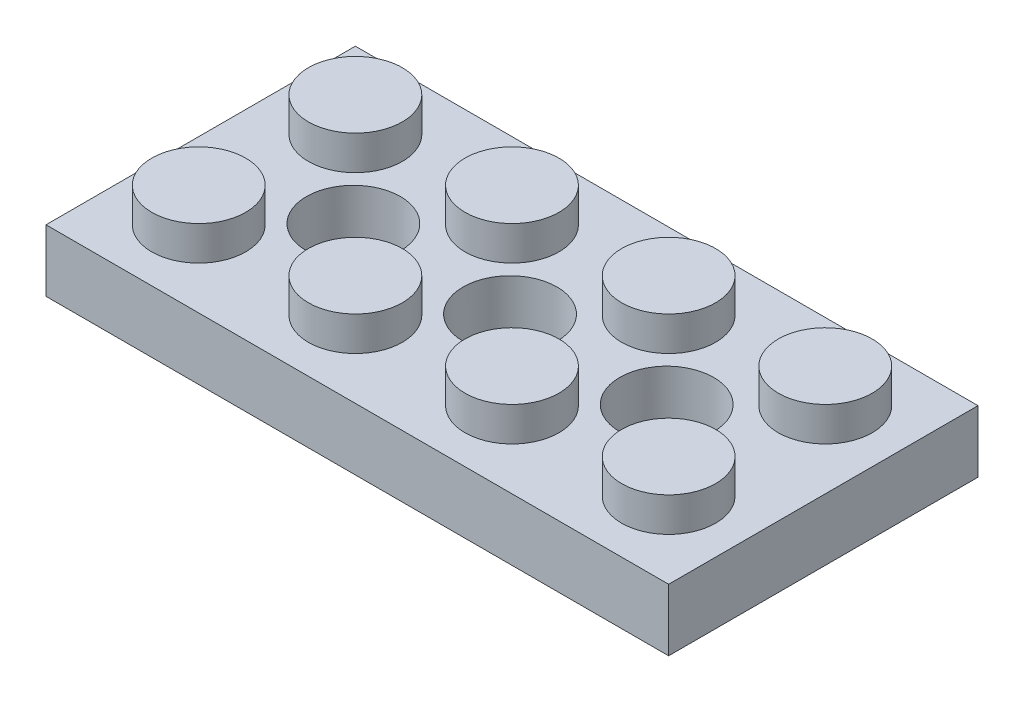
ISO-10303-21;
HEADER;
FILE_DESCRIPTION(('STEP AP214'),'2;1');
FILE_NAME('part.step','',(''),(''),'','','');
FILE_SCHEMA(('AUTOMOTIVE_DESIGN { 1 0 10303 214 1 1 1 1 }'));
ENDSEC;
DATA;
#1=APPLICATION_CONTEXT('core data for automotive mechanical design processes');
#2=APPLICATION_PROTOCOL_DEFINITION('international standard','automotive_design',2000,#1);
#3=PRODUCT_CONTEXT('',#1,'mechanical');
#4=PRODUCT('Part','Part','',(#3));
#5=PRODUCT_RELATED_PRODUCT_CATEGORY('part','',(#4));
#6=PRODUCT_DEFINITION_FORMATION('','',#4);
#7=PRODUCT_DEFINITION_CONTEXT('part definition',#1,'design');
#8=PRODUCT_DEFINITION('design','',#6,#7);
#9=PRODUCT_DEFINITION_SHAPE('','',#8);
#10=(LENGTH_UNIT() NAMED_UNIT(*) SI_UNIT(.MILLI.,.METRE.));
#11=(NAMED_UNIT(*) PLANE_ANGLE_UNIT() SI_UNIT($,.RADIAN.));
#12=(NAMED_UNIT(*) SI_UNIT($,.STERADIAN.) SOLID_ANGLE_UNIT());
#13=UNCERTAINTY_MEASURE_WITH_UNIT(LENGTH_MEASURE(1.E-05),#10,'distance_accuracy_value','');
#14=(GEOMETRIC_REPRESENTATION_CONTEXT(3) GLOBAL_UNCERTAINTY_ASSIGNED_CONTEXT((#13)) GLOBAL_UNIT_ASSIGNED_CONTEXT((#10,
#11,#12)) REPRESENTATION_CONTEXT('',''));
#15=CARTESIAN_POINT('',(0.,0.,0.));
#16=DIRECTION('',(0.,0.,1.));
#17=DIRECTION('',(1.,0.,0.));
#18=AXIS2_PLACEMENT_3D('',#15,#16,#17);
#19=CARTESIAN_POINT('',(-8.09999999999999,0.,0.));
#20=DIRECTION('',(0.,1.,0.));
#21=DIRECTION('',(0.,0.,1.));
#22=AXIS2_PLACEMENT_3D('',#19,#20,#21);
#23=CYLINDRICAL_SURFACE('',#22,3.4);
#24=CARTESIAN_POINT('',(-8.09999999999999,0.,0.));
#25=DIRECTION('',(0.,-1.,0.));
#26=DIRECTION('',(0.,0.,-1.));
#27=AXIS2_PLACEMENT_3D('',#24,#25,#26);
#28=CIRCLE('',#27,3.4);
#29=CARTESIAN_POINT('',(-8.09999999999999,0.,-3.4));
#30=VERTEX_POINT('',#29);
#31=EDGE_CURVE('E44',#30,#30,#28,.T.);
#32=ORIENTED_EDGE('',*,*,#31,.F.);
#33=EDGE_LOOP('',(#32));
#34=FACE_BOUND('',#33,.T.);
#35=CARTESIAN_POINT('',(-8.09999999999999,2.5,0.));
#36=DIRECTION('',(0.,-1.,0.));
#37=DIRECTION('',(0.,0.,-1.));
#38=AXIS2_PLACEMENT_3D('',#35,#36,#37);
#39=CIRCLE('',#38,3.4);
#40=CARTESIAN_POINT('',(-8.09999999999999,2.5,-3.4));
#41=VERTEX_POINT('',#40);
#42=EDGE_CURVE('E11',#41,#41,#39,.T.);
#43=ORIENTED_EDGE('',*,*,#42,.T.);
#44=EDGE_LOOP('',(#43));
#45=FACE_BOUND('',#44,.T.);
#46=ADVANCED_FACE('F37',(#34,#45),#23,.T.);
#47=CARTESIAN_POINT('',(-8.09999999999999,0.,0.));
#48=DIRECTION('',(0.,-1.,0.));
#49=DIRECTION('',(0.,0.,-1.));
#50=AXIS2_PLACEMENT_3D('',#47,#48,#49);
#51=PLANE('',#50);
#52=CARTESIAN_POINT('',(-8.09999999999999,0.,0.));
#53=DIRECTION('',(0.,-1.,0.));
#54=DIRECTION('',(0.,0.,-1.));
#55=AXIS2_PLACEMENT_3D('',#52,#53,#54);
#56=CIRCLE('',#55,2.4);
#57=CARTESIAN_POINT('',(-8.09999999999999,0.,-2.4));
#58=VERTEX_POINT('',#57);
#59=EDGE_CURVE('E204',#58,#58,#56,.T.);
#60=ORIENTED_EDGE('',*,*,#59,.F.);
#61=EDGE_LOOP('',(#60));
#62=FACE_BOUND('',#61,.T.);
#63=ORIENTED_EDGE('',*,*,#31,.T.);
#64=EDGE_LOOP('',(#63));
#65=FACE_BOUND('',#64,.T.);
#66=ADVANCED_FACE('F209',(#62,#65),#51,.T.);
#67=CARTESIAN_POINT('',(-8.09999999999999,4.916,0.));
#68=DIRECTION('',(0.,-1.,0.));
#69=DIRECTION('',(0.,0.,-1.));
#70=AXIS2_PLACEMENT_3D('',#67,#68,#69);
#71=CYLINDRICAL_SURFACE('',#70,2.4);
#72=CARTESIAN_POINT('',(-8.09999999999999,3.166,0.));
#73=DIRECTION('',(0.,1.,0.));
#74=DIRECTION('',(0.,0.,1.));
#75=AXIS2_PLACEMENT_3D('',#72,#73,#74);
#76=CIRCLE('',#75,2.4);
#77=CARTESIAN_POINT('',(-8.09999999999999,3.166,2.4));
#78=VERTEX_POINT('',#77);
#79=EDGE_CURVE('E201',#78,#78,#76,.T.);
#80=ORIENTED_EDGE('',*,*,#79,.T.);
#81=EDGE_LOOP('',(#80));
#82=FACE_BOUND('',#81,.T.);
#83=ORIENTED_EDGE('',*,*,#59,.T.);
#84=EDGE_LOOP('',(#83));
#85=FACE_BOUND('',#84,.T.);
#86=ADVANCED_FACE('F225',(#82,#85),#71,.F.);
#87=CARTESIAN_POINT('',(-0.099999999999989,0.,0.));
#88=DIRECTION('',(0.,1.,0.));
#89=DIRECTION('',(0.,0.,1.));
#90=AXIS2_PLACEMENT_3D('',#87,#88,#89);
#91=CYLINDRICAL_SURFACE('',#90,3.4);
#92=CARTESIAN_POINT('',(-0.099999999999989,0.,0.));
#93=DIRECTION('',(0.,-1.,0.));
#94=DIRECTION('',(0.,0.,-1.));
#95=AXIS2_PLACEMENT_3D('',#92,#93,#94);
#96=CIRCLE('',#95,3.4);
#97=CARTESIAN_POINT('',(-0.099999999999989,0.,-3.4));
#98=VERTEX_POINT('',#97);
#99=EDGE_CURVE('E195',#98,#98,#96,.T.);
#100=ORIENTED_EDGE('',*,*,#99,.F.);
#101=EDGE_LOOP('',(#100));
#102=FACE_BOUND('',#101,.T.);
#103=CARTESIAN_POINT('',(-0.099999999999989,2.5,0.));
#104=DIRECTION('',(0.,-1.,0.));
#105=DIRECTION('',(0.,0.,-1.));
#106=AXIS2_PLACEMENT_3D('',#103,#104,#105);
#107=CIRCLE('',#106,3.4);
#108=CARTESIAN_POINT('',(-0.099999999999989,2.5,-3.4));
#109=VERTEX_POINT('',#108);
#110=EDGE_CURVE('E198',#109,#109,#107,.T.);
#111=ORIENTED_EDGE('',*,*,#110,.T.);
#112=EDGE_LOOP('',(#111));
#113=FACE_BOUND('',#112,.T.);
#114=ADVANCED_FACE('F222',(#102,#113),#91,.T.);
#115=CARTESIAN_POINT('',(-0.099999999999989,0.,0.));
#116=DIRECTION('',(0.,-1.,0.));
#117=DIRECTION('',(0.,0.,-1.));
#118=AXIS2_PLACEMENT_3D('',#115,#116,#117);
#119=PLANE('',#118);
#120=CARTESIAN_POINT('',(-0.099999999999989,0.,0.));
#121=DIRECTION('',(0.,-1.,0.));
#122=DIRECTION('',(0.,0.,-1.));
#123=AXIS2_PLACEMENT_3D('',#120,#121,#122);
#124=CIRCLE('',#123,2.4);
#125=CARTESIAN_POINT('',(-0.099999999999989,0.,-2.4));
#126=VERTEX_POINT('',#125);
#127=EDGE_CURVE('E192',#126,#126,#124,.T.);
#128=ORIENTED_EDGE('',*,*,#127,.F.);
#129=EDGE_LOOP('',(#128));
#130=FACE_BOUND('',#129,.T.);
#131=ORIENTED_EDGE('',*,*,#99,.T.);
#132=EDGE_LOOP('',(#131));
#133=FACE_BOUND('',#132,.T.);
#134=ADVANCED_FACE('F224',(#130,#133),#119,.T.);
#135=CARTESIAN_POINT('',(-0.099999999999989,4.916,0.));
#136=DIRECTION('',(0.,-1.,0.));
#137=DIRECTION('',(0.,0.,-1.));
#138=AXIS2_PLACEMENT_3D('',#135,#136,#137);
#139=CYLINDRICAL_SURFACE('',#138,2.4);
#140=CARTESIAN_POINT('',(-0.099999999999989,3.166,0.));
#141=DIRECTION('',(0.,1.,0.));
#142=DIRECTION('',(0.,0.,1.));
#143=AXIS2_PLACEMENT_3D('',#140,#141,#142);
#144=CIRCLE('',#143,2.4);
#145=CARTESIAN_POINT('',(-0.099999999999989,3.166,2.4));
#146=VERTEX_POINT('',#145);
#147=EDGE_CURVE('E189',#146,#146,#144,.T.);
#148=ORIENTED_EDGE('',*,*,#147,.T.);
#149=EDGE_LOOP('',(#148));
#150=FACE_BOUND('',#149,.T.);
#151=ORIENTED_EDGE('',*,*,#127,.T.);
#152=EDGE_LOOP('',(#151));
#153=FACE_BOUND('',#152,.T.);
#154=ADVANCED_FACE('F232',(#150,#153),#139,.F.);
#155=CARTESIAN_POINT('',(-15.9,3.166,-7.9));
#156=DIRECTION('',(0.,1.,0.));
#157=DIRECTION('',(0.,0.,1.));
#158=AXIS2_PLACEMENT_3D('',#155,#156,#157);
#159=PLANE('',#158);
#160=ORIENTED_EDGE('',*,*,#79,.F.);
#161=EDGE_LOOP('',(#160));
#162=FACE_BOUND('',#161,.T.);
#163=ORIENTED_EDGE('',*,*,#147,.F.);
#164=EDGE_LOOP('',(#163));
#165=FACE_BOUND('',#164,.T.);
#166=CARTESIAN_POINT('',(-4.00000000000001,3.166,-4.));
#167=DIRECTION('',(0.,1.,0.));
#168=DIRECTION('',(0.,0.,1.));
#169=AXIS2_PLACEMENT_3D('',#166,#167,#168);
#170=CIRCLE('',#169,2.4);
#171=CARTESIAN_POINT('',(-4.00000000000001,3.166,-1.6));
#172=VERTEX_POINT('',#171);
#173=EDGE_CURVE('E538',#172,#172,#170,.T.);
#174=ORIENTED_EDGE('',*,*,#173,.F.);
#175=EDGE_LOOP('',(#174));
#176=FACE_BOUND('',#175,.T.);
#177=CARTESIAN_POINT('',(-12.,3.166,4.));
#178=DIRECTION('',(0.,1.,0.));
#179=DIRECTION('',(0.,0.,1.));
#180=AXIS2_PLACEMENT_3D('',#177,#178,#179);
#181=CIRCLE('',#180,2.4);
#182=CARTESIAN_POINT('',(-12.,3.166,6.4));
#183=VERTEX_POINT('',#182);
#184=EDGE_CURVE('E555',#183,#183,#181,.T.);
#185=ORIENTED_EDGE('',*,*,#184,.F.);
#186=EDGE_LOOP('',(#185));
#187=FACE_BOUND('',#186,.T.);
#188=CARTESIAN_POINT('',(3.99999999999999,3.166,4.));
#189=DIRECTION('',(0.,1.,0.));
#190=DIRECTION('',(0.,0.,1.));
#191=AXIS2_PLACEMENT_3D('',#188,#189,#190);
#192=CIRCLE('',#191,2.4);
#193=CARTESIAN_POINT('',(3.99999999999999,3.166,6.4));
#194=VERTEX_POINT('',#193);
#195=EDGE_CURVE('E567',#194,#194,#192,.T.);
#196=ORIENTED_EDGE('',*,*,#195,.F.);
#197=EDGE_LOOP('',(#196));
#198=FACE_BOUND('',#197,.T.);
#199=CARTESIAN_POINT('',(7.90000000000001,3.166,0.));
#200=DIRECTION('',(0.,1.,0.));
#201=DIRECTION('',(0.,0.,1.));
#202=AXIS2_PLACEMENT_3D('',#199,#200,#201);
#203=CIRCLE('',#202,2.4);
#204=CARTESIAN_POINT('',(7.90000000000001,3.166,2.4));
#205=VERTEX_POINT('',#204);
#206=EDGE_CURVE('E576',#205,#205,#203,.T.);
#207=ORIENTED_EDGE('',*,*,#206,.F.);
#208=EDGE_LOOP('',(#207));
#209=FACE_BOUND('',#208,.T.);
#210=CARTESIAN_POINT('',(12.,3.166,-4.));
#211=DIRECTION('',(0.,1.,0.));
#212=DIRECTION('',(0.,0.,1.));
#213=AXIS2_PLACEMENT_3D('',#210,#211,#212);
#214=CIRCLE('',#213,2.4);
#215=CARTESIAN_POINT('',(12.,3.166,-1.6));
#216=VERTEX_POINT('',#215);
#217=EDGE_CURVE('E158',#216,#216,#214,.T.);
#218=ORIENTED_EDGE('',*,*,#217,.F.);
#219=EDGE_LOOP('',(#218));
#220=FACE_BOUND('',#219,.T.);
#221=DIRECTION('',(0.,0.,1.));
#222=VECTOR('',#221,1.);
#223=CARTESIAN_POINT('',(-15.9,3.166,7.9));
#224=LINE('',#223,#222);
#225=CARTESIAN_POINT('',(-15.9,3.166,-7.9));
#226=VERTEX_POINT('',#225);
#227=CARTESIAN_POINT('',(-15.9,3.166,7.9));
#228=VERTEX_POINT('',#227);
#229=EDGE_CURVE('E167',#226,#228,#224,.T.);
#230=ORIENTED_EDGE('',*,*,#229,.T.);
#231=DIRECTION('',(1.,0.,0.));
#232=VECTOR('',#231,1.);
#233=CARTESIAN_POINT('',(15.9,3.166,7.9));
#234=LINE('',#233,#232);
#235=CARTESIAN_POINT('',(15.9,3.166,7.9));
#236=VERTEX_POINT('',#235);
#237=EDGE_CURVE('E89',#228,#236,#234,.T.);
#238=ORIENTED_EDGE('',*,*,#237,.T.);
#239=DIRECTION('',(0.,0.,-1.));
#240=VECTOR('',#239,1.);
#241=CARTESIAN_POINT('',(15.9,3.166,7.9));
#242=LINE('',#241,#240);
#243=CARTESIAN_POINT('',(15.9,3.166,-7.9));
#244=VERTEX_POINT('',#243);
#245=EDGE_CURVE('E170',#236,#244,#242,.T.);
#246=ORIENTED_EDGE('',*,*,#245,.T.);
#247=DIRECTION('',(-1.,0.,0.));
#248=VECTOR('',#247,1.);
#249=CARTESIAN_POINT('',(15.9,3.166,-7.9));
#250=LINE('',#249,#248);
#251=EDGE_CURVE('E60',#244,#226,#250,.T.);
#252=ORIENTED_EDGE('',*,*,#251,.T.);
#253=EDGE_LOOP('',(#230,#238,#246,#252));
#254=FACE_BOUND('',#253,.T.);
#255=CARTESIAN_POINT('',(12.,3.166,4.));
#256=DIRECTION('',(0.,1.,0.));
#257=DIRECTION('',(0.,0.,1.));
#258=AXIS2_PLACEMENT_3D('',#255,#256,#257);
#259=CIRCLE('',#258,2.4);
#260=CARTESIAN_POINT('',(12.,3.166,6.4));
#261=VERTEX_POINT('',#260);
#262=EDGE_CURVE('E151',#261,#261,#259,.T.);
#263=ORIENTED_EDGE('',*,*,#262,.F.);
#264=EDGE_LOOP('',(#263));
#265=FACE_BOUND('',#264,.T.);
#266=CARTESIAN_POINT('',(-4.00000000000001,3.166,4.));
#267=DIRECTION('',(0.,1.,0.));
#268=DIRECTION('',(0.,0.,1.));
#269=AXIS2_PLACEMENT_3D('',#266,#267,#268);
#270=CIRCLE('',#269,2.4);
#271=CARTESIAN_POINT('',(-4.00000000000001,3.166,6.4));
#272=VERTEX_POINT('',#271);
#273=EDGE_CURVE('E561',#272,#272,#270,.T.);
#274=ORIENTED_EDGE('',*,*,#273,.F.);
#275=EDGE_LOOP('',(#274));
#276=FACE_BOUND('',#275,.T.);
#277=CARTESIAN_POINT('',(3.99999999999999,3.166,-4.));
#278=DIRECTION('',(0.,1.,0.));
#279=DIRECTION('',(0.,0.,1.));
#280=AXIS2_PLACEMENT_3D('',#277,#278,#279);
#281=CIRCLE('',#280,2.4);
#282=CARTESIAN_POINT('',(3.99999999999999,3.166,-1.6));
#283=VERTEX_POINT('',#282);
#284=EDGE_CURVE('E549',#283,#283,#281,.T.);
#285=ORIENTED_EDGE('',*,*,#284,.F.);
#286=EDGE_LOOP('',(#285));
#287=FACE_BOUND('',#286,.T.);
#288=CARTESIAN_POINT('',(-12.,3.166,-4.));
#289=DIRECTION('',(0.,1.,0.));
#290=DIRECTION('',(0.,0.,1.));
#291=AXIS2_PLACEMENT_3D('',#288,#289,#290);
#292=CIRCLE('',#291,2.4);
#293=CARTESIAN_POINT('',(-12.,3.166,-1.6));
#294=VERTEX_POINT('',#293);
#295=EDGE_CURVE('E539',#294,#294,#292,.T.);
#296=ORIENTED_EDGE('',*,*,#295,.F.);
#297=EDGE_LOOP('',(#296));
#298=FACE_BOUND('',#297,.T.);
#299=ADVANCED_FACE('F218',(#162,#165,#176,#187,#198,#209,#220,#254,#265,#276,#287,#298),#159,.T.);
#300=CARTESIAN_POINT('',(-15.4,2.5,7.4));
#301=DIRECTION('',(0.,-1.,0.));
#302=DIRECTION('',(0.,0.,-1.));
#303=AXIS2_PLACEMENT_3D('',#300,#301,#302);
#304=PLANE('',#303);
#305=ORIENTED_EDGE('',*,*,#42,.F.);
#306=EDGE_LOOP('',(#305));
#307=FACE_BOUND('',#306,.T.);
#308=ORIENTED_EDGE('',*,*,#110,.F.);
#309=EDGE_LOOP('',(#308));
#310=FACE_BOUND('',#309,.T.);
#311=DIRECTION('',(0.,0.,-1.));
#312=VECTOR('',#311,1.);
#313=CARTESIAN_POINT('',(-15.4,2.5,-7.4));
#314=LINE('',#313,#312);
#315=CARTESIAN_POINT('',(-15.4,2.5,7.4));
#316=VERTEX_POINT('',#315);
#317=CARTESIAN_POINT('',(-15.4,2.5,-7.4));
#318=VERTEX_POINT('',#317);
#319=EDGE_CURVE('E113',#316,#318,#314,.T.);
#320=ORIENTED_EDGE('',*,*,#319,.T.);
#321=DIRECTION('',(1.,0.,0.));
#322=VECTOR('',#321,1.);
#323=CARTESIAN_POINT('',(15.4,2.5,-7.4));
#324=LINE('',#323,#322);
#325=CARTESIAN_POINT('',(15.4,2.5,-7.4));
#326=VERTEX_POINT('',#325);
#327=EDGE_CURVE('E122',#318,#326,#324,.T.);
#328=ORIENTED_EDGE('',*,*,#327,.T.);
#329=DIRECTION('',(0.,0.,1.));
#330=VECTOR('',#329,1.);
#331=CARTESIAN_POINT('',(15.4,2.5,-7.4));
#332=LINE('',#331,#330);
#333=CARTESIAN_POINT('',(15.4,2.5,7.4));
#334=VERTEX_POINT('',#333);
#335=EDGE_CURVE('E127',#326,#334,#332,.T.);
#336=ORIENTED_EDGE('',*,*,#335,.T.);
#337=DIRECTION('',(-1.,0.,0.));
#338=VECTOR('',#337,1.);
#339=CARTESIAN_POINT('',(15.4,2.5,7.4));
#340=LINE('',#339,#338);
#341=EDGE_CURVE('E119',#334,#316,#340,.T.);
#342=ORIENTED_EDGE('',*,*,#341,.T.);
#343=EDGE_LOOP('',(#320,#328,#336,#342));
#344=FACE_BOUND('',#343,.T.);
#345=CARTESIAN_POINT('',(7.90000000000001,2.5,0.));
#346=DIRECTION('',(0.,-1.,0.));
#347=DIRECTION('',(0.,0.,-1.));
#348=AXIS2_PLACEMENT_3D('',#345,#346,#347);
#349=CIRCLE('',#348,3.4);
#350=CARTESIAN_POINT('',(7.90000000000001,2.5,-3.4));
#351=VERTEX_POINT('',#350);
#352=EDGE_CURVE('E138',#351,#351,#349,.T.);
#353=ORIENTED_EDGE('',*,*,#352,.F.);
#354=EDGE_LOOP('',(#353));
#355=FACE_BOUND('',#354,.T.);
#356=ADVANCED_FACE('F129',(#307,#310,#344,#355),#304,.T.);
#357=CARTESIAN_POINT('',(-15.9,3.166,7.9));
#358=DIRECTION('',(1.,0.,0.));
#359=DIRECTION('',(0.,0.,-1.));
#360=AXIS2_PLACEMENT_3D('',#357,#358,#359);
#361=PLANE('',#360);
#362=DIRECTION('',(0.,0.,1.));
#363=VECTOR('',#362,1.);
#364=CARTESIAN_POINT('',(-15.9,0.,7.9));
#365=LINE('',#364,#363);
#366=CARTESIAN_POINT('',(-15.9,0.,-7.9));
#367=VERTEX_POINT('',#366);
#368=CARTESIAN_POINT('',(-15.9,0.,7.9));
#369=VERTEX_POINT('',#368);
#370=EDGE_CURVE('E164',#367,#369,#365,.T.);
#371=ORIENTED_EDGE('',*,*,#370,.T.);
#372=DIRECTION('',(0.,-1.,0.));
#373=VECTOR('',#372,1.);
#374=CARTESIAN_POINT('',(-15.9,3.166,7.9));
#375=LINE('',#374,#373);
#376=EDGE_CURVE('E187',#228,#369,#375,.T.);
#377=ORIENTED_EDGE('',*,*,#376,.F.);
#378=ORIENTED_EDGE('',*,*,#229,.F.);
#379=DIRECTION('',(0.,-1.,0.));
#380=VECTOR('',#379,1.);
#381=CARTESIAN_POINT('',(-15.9,3.166,-7.9));
#382=LINE('',#381,#380);
#383=EDGE_CURVE('E173',#226,#367,#382,.T.);
#384=ORIENTED_EDGE('',*,*,#383,.T.);
#385=EDGE_LOOP('',(#371,#377,#378,#384));
#386=FACE_BOUND('',#385,.T.);
#387=ADVANCED_FACE('F217',(#386),#361,.F.);
#388=CARTESIAN_POINT('',(15.9,3.166,7.9));
#389=DIRECTION('',(0.,0.,-1.));
#390=DIRECTION('',(-1.,0.,0.));
#391=AXIS2_PLACEMENT_3D('',#388,#389,#390);
#392=PLANE('',#391);
#393=DIRECTION('',(1.,0.,0.));
#394=VECTOR('',#393,1.);
#395=CARTESIAN_POINT('',(15.9,0.,7.9));
#396=LINE('',#395,#394);
#397=CARTESIAN_POINT('',(15.9,0.,7.9));
#398=VERTEX_POINT('',#397);
#399=EDGE_CURVE('E176',#369,#398,#396,.T.);
#400=ORIENTED_EDGE('',*,*,#399,.T.);
#401=DIRECTION('',(0.,-1.,0.));
#402=VECTOR('',#401,1.);
#403=CARTESIAN_POINT('',(15.9,3.166,7.9));
#404=LINE('',#403,#402);
#405=EDGE_CURVE('E184',#236,#398,#404,.T.);
#406=ORIENTED_EDGE('',*,*,#405,.F.);
#407=ORIENTED_EDGE('',*,*,#237,.F.);
#408=ORIENTED_EDGE('',*,*,#376,.T.);
#409=EDGE_LOOP('',(#400,#406,#407,#408));
#410=FACE_BOUND('',#409,.T.);
#411=ADVANCED_FACE('F296',(#410),#392,.F.);
#412=CARTESIAN_POINT('',(15.9,3.166,7.9));
#413=DIRECTION('',(-1.,0.,0.));
#414=DIRECTION('',(0.,0.,1.));
#415=AXIS2_PLACEMENT_3D('',#412,#413,#414);
#416=PLANE('',#415);
#417=DIRECTION('',(0.,0.,-1.));
#418=VECTOR('',#417,1.);
#419=CARTESIAN_POINT('',(15.9,0.,7.9));
#420=LINE('',#419,#418);
#421=CARTESIAN_POINT('',(15.9,0.,-7.9));
#422=VERTEX_POINT('',#421);
#423=EDGE_CURVE('E178',#398,#422,#420,.T.);
#424=ORIENTED_EDGE('',*,*,#423,.T.);
#425=DIRECTION('',(0.,-1.,0.));
#426=VECTOR('',#425,1.);
#427=CARTESIAN_POINT('',(15.9,3.166,-7.9));
#428=LINE('',#427,#426);
#429=EDGE_CURVE('E182',#244,#422,#428,.T.);
#430=ORIENTED_EDGE('',*,*,#429,.F.);
#431=ORIENTED_EDGE('',*,*,#245,.F.);
#432=ORIENTED_EDGE('',*,*,#405,.T.);
#433=EDGE_LOOP('',(#424,#430,#431,#432));
#434=FACE_BOUND('',#433,.T.);
#435=ADVANCED_FACE('F304',(#434),#416,.F.);
#436=CARTESIAN_POINT('',(15.9,3.166,-7.9));
#437=DIRECTION('',(0.,0.,1.));
#438=DIRECTION('',(1.,0.,0.));
#439=AXIS2_PLACEMENT_3D('',#436,#437,#438);
#440=PLANE('',#439);
#441=DIRECTION('',(-1.,0.,0.));
#442=VECTOR('',#441,1.);
#443=CARTESIAN_POINT('',(15.9,0.,-7.9));
#444=LINE('',#443,#442);
#445=EDGE_CURVE('E81',#422,#367,#444,.T.);
#446=ORIENTED_EDGE('',*,*,#445,.T.);
#447=ORIENTED_EDGE('',*,*,#383,.F.);
#448=ORIENTED_EDGE('',*,*,#251,.F.);
#449=ORIENTED_EDGE('',*,*,#429,.T.);
#450=EDGE_LOOP('',(#446,#447,#448,#449));
#451=FACE_BOUND('',#450,.T.);
#452=ADVANCED_FACE('F311',(#451),#440,.F.);
#453=CARTESIAN_POINT('',(-15.9,0.,-7.9));
#454=DIRECTION('',(0.,1.,0.));
#455=DIRECTION('',(0.,0.,1.));
#456=AXIS2_PLACEMENT_3D('',#453,#454,#455);
#457=PLANE('',#456);
#458=DIRECTION('',(1.,0.,0.));
#459=VECTOR('',#458,1.);
#460=CARTESIAN_POINT('',(15.4,0.,-7.4));
#461=LINE('',#460,#459);
#462=CARTESIAN_POINT('',(-15.4,0.,-7.4));
#463=VERTEX_POINT('',#462);
#464=CARTESIAN_POINT('',(15.4,0.,-7.4));
#465=VERTEX_POINT('',#464);
#466=EDGE_CURVE('E144',#463,#465,#461,.T.);
#467=ORIENTED_EDGE('',*,*,#466,.F.);
#468=DIRECTION('',(0.,0.,-1.));
#469=VECTOR('',#468,1.);
#470=CARTESIAN_POINT('',(-15.4,0.,-7.4));
#471=LINE('',#470,#469);
#472=CARTESIAN_POINT('',(-15.4,0.,7.4));
#473=VERTEX_POINT('',#472);
#474=EDGE_CURVE('E51',#473,#463,#471,.T.);
#475=ORIENTED_EDGE('',*,*,#474,.F.);
#476=DIRECTION('',(-1.,0.,0.));
#477=VECTOR('',#476,1.);
#478=CARTESIAN_POINT('',(15.4,0.,7.4));
#479=LINE('',#478,#477);
#480=CARTESIAN_POINT('',(15.4,0.,7.4));
#481=VERTEX_POINT('',#480);
#482=EDGE_CURVE('E132',#481,#473,#479,.T.);
#483=ORIENTED_EDGE('',*,*,#482,.F.);
#484=DIRECTION('',(0.,0.,1.));
#485=VECTOR('',#484,1.);
#486=CARTESIAN_POINT('',(15.4,0.,-7.4));
#487=LINE('',#486,#485);
#488=EDGE_CURVE('E135',#465,#481,#487,.T.);
#489=ORIENTED_EDGE('',*,*,#488,.F.);
#490=EDGE_LOOP('',(#467,#475,#483,#489));
#491=FACE_BOUND('',#490,.T.);
#492=ORIENTED_EDGE('',*,*,#370,.F.);
#493=ORIENTED_EDGE('',*,*,#445,.F.);
#494=ORIENTED_EDGE('',*,*,#423,.F.);
#495=ORIENTED_EDGE('',*,*,#399,.F.);
#496=EDGE_LOOP('',(#492,#493,#494,#495));
#497=FACE_BOUND('',#496,.T.);
#498=ADVANCED_FACE('F319',(#491,#497),#457,.F.);
#499=CARTESIAN_POINT('',(12.,4.916,-4.));
#500=DIRECTION('',(0.,-1.,0.));
#501=DIRECTION('',(0.,0.,-1.));
#502=AXIS2_PLACEMENT_3D('',#499,#500,#501);
#503=CYLINDRICAL_SURFACE('',#502,2.4);
#504=CARTESIAN_POINT('',(12.,4.916,-4.));
#505=DIRECTION('',(0.,1.,0.));
#506=DIRECTION('',(0.,0.,1.));
#507=AXIS2_PLACEMENT_3D('',#504,#505,#506);
#508=CIRCLE('',#507,2.4);
#509=CARTESIAN_POINT('',(12.,4.916,-1.6));
#510=VERTEX_POINT('',#509);
#511=EDGE_CURVE('E161',#510,#510,#508,.T.);
#512=ORIENTED_EDGE('',*,*,#511,.F.);
#513=EDGE_LOOP('',(#512));
#514=FACE_BOUND('',#513,.T.);
#515=ORIENTED_EDGE('',*,*,#217,.T.);
#516=EDGE_LOOP('',(#515));
#517=FACE_BOUND('',#516,.T.);
#518=ADVANCED_FACE('F327',(#514,#517),#503,.T.);
#519=CARTESIAN_POINT('',(12.,4.916,-4.));
#520=DIRECTION('',(0.,1.,0.));
#521=DIRECTION('',(0.,0.,1.));
#522=AXIS2_PLACEMENT_3D('',#519,#520,#521);
#523=PLANE('',#522);
#524=ORIENTED_EDGE('',*,*,#511,.T.);
#525=EDGE_LOOP('',(#524));
#526=FACE_BOUND('',#525,.T.);
#527=ADVANCED_FACE('F336',(#526),#523,.T.);
#528=CARTESIAN_POINT('',(12.,4.916,4.));
#529=DIRECTION('',(0.,-1.,0.));
#530=DIRECTION('',(0.,0.,-1.));
#531=AXIS2_PLACEMENT_3D('',#528,#529,#530);
#532=CYLINDRICAL_SURFACE('',#531,2.4);
#533=CARTESIAN_POINT('',(12.,4.916,4.));
#534=DIRECTION('',(0.,1.,0.));
#535=DIRECTION('',(0.,0.,1.));
#536=AXIS2_PLACEMENT_3D('',#533,#534,#535);
#537=CIRCLE('',#536,2.4);
#538=CARTESIAN_POINT('',(12.,4.916,6.4));
#539=VERTEX_POINT('',#538);
#540=EDGE_CURVE('E155',#539,#539,#537,.T.);
#541=ORIENTED_EDGE('',*,*,#540,.F.);
#542=EDGE_LOOP('',(#541));
#543=FACE_BOUND('',#542,.T.);
#544=ORIENTED_EDGE('',*,*,#262,.T.);
#545=EDGE_LOOP('',(#544));
#546=FACE_BOUND('',#545,.T.);
#547=ADVANCED_FACE('F344',(#543,#546),#532,.T.);
#548=CARTESIAN_POINT('',(12.,4.916,4.));
#549=DIRECTION('',(0.,1.,0.));
#550=DIRECTION('',(0.,0.,1.));
#551=AXIS2_PLACEMENT_3D('',#548,#549,#550);
#552=PLANE('',#551);
#553=ORIENTED_EDGE('',*,*,#540,.T.);
#554=EDGE_LOOP('',(#553));
#555=FACE_BOUND('',#554,.T.);
#556=ADVANCED_FACE('F352',(#555),#552,.T.);
#557=CARTESIAN_POINT('',(-15.4,2.5,-7.4));
#558=DIRECTION('',(-1.,0.,0.));
#559=DIRECTION('',(0.,0.,1.));
#560=AXIS2_PLACEMENT_3D('',#557,#558,#559);
#561=PLANE('',#560);
#562=ORIENTED_EDGE('',*,*,#474,.T.);
#563=DIRECTION('',(0.,-1.,0.));
#564=VECTOR('',#563,1.);
#565=CARTESIAN_POINT('',(-15.4,2.5,-7.4));
#566=LINE('',#565,#564);
#567=EDGE_CURVE('E109',#318,#463,#566,.T.);
#568=ORIENTED_EDGE('',*,*,#567,.F.);
#569=ORIENTED_EDGE('',*,*,#319,.F.);
#570=DIRECTION('',(0.,-1.,0.));
#571=VECTOR('',#570,1.);
#572=CARTESIAN_POINT('',(-15.4,2.5,7.4));
#573=LINE('',#572,#571);
#574=EDGE_CURVE('E149',#316,#473,#573,.T.);
#575=ORIENTED_EDGE('',*,*,#574,.T.);
#576=EDGE_LOOP('',(#562,#568,#569,#575));
#577=FACE_BOUND('',#576,.T.);
#578=ADVANCED_FACE('F111',(#577),#561,.F.);
#579=CARTESIAN_POINT('',(15.4,2.5,7.4));
#580=DIRECTION('',(0.,0.,1.));
#581=DIRECTION('',(1.,0.,0.));
#582=AXIS2_PLACEMENT_3D('',#579,#580,#581);
#583=PLANE('',#582);
#584=ORIENTED_EDGE('',*,*,#482,.T.);
#585=ORIENTED_EDGE('',*,*,#574,.F.);
#586=ORIENTED_EDGE('',*,*,#341,.F.);
#587=DIRECTION('',(0.,-1.,0.));
#588=VECTOR('',#587,1.);
#589=CARTESIAN_POINT('',(15.4,2.5,7.4));
#590=LINE('',#589,#588);
#591=EDGE_CURVE('E152',#334,#481,#590,.T.);
#592=ORIENTED_EDGE('',*,*,#591,.T.);
#593=EDGE_LOOP('',(#584,#585,#586,#592));
#594=FACE_BOUND('',#593,.T.);
#595=ADVANCED_FACE('F365',(#594),#583,.F.);
#596=CARTESIAN_POINT('',(15.4,2.5,-7.4));
#597=DIRECTION('',(1.,0.,0.));
#598=DIRECTION('',(0.,0.,-1.));
#599=AXIS2_PLACEMENT_3D('',#596,#597,#598);
#600=PLANE('',#599);
#601=ORIENTED_EDGE('',*,*,#488,.T.);
#602=ORIENTED_EDGE('',*,*,#591,.F.);
#603=ORIENTED_EDGE('',*,*,#335,.F.);
#604=DIRECTION('',(0.,-1.,0.));
#605=VECTOR('',#604,1.);
#606=CARTESIAN_POINT('',(15.4,2.5,-7.4));
#607=LINE('',#606,#605);
#608=EDGE_CURVE('E118',#326,#465,#607,.T.);
#609=ORIENTED_EDGE('',*,*,#608,.T.);
#610=EDGE_LOOP('',(#601,#602,#603,#609));
#611=FACE_BOUND('',#610,.T.);
#612=ADVANCED_FACE('F372',(#611),#600,.F.);
#613=CARTESIAN_POINT('',(15.4,2.5,-7.4));
#614=DIRECTION('',(0.,0.,-1.));
#615=DIRECTION('',(-1.,0.,0.));
#616=AXIS2_PLACEMENT_3D('',#613,#614,#615);
#617=PLANE('',#616);
#618=ORIENTED_EDGE('',*,*,#466,.T.);
#619=ORIENTED_EDGE('',*,*,#608,.F.);
#620=ORIENTED_EDGE('',*,*,#327,.F.);
#621=ORIENTED_EDGE('',*,*,#567,.T.);
#622=EDGE_LOOP('',(#618,#619,#620,#621));
#623=FACE_BOUND('',#622,.T.);
#624=ADVANCED_FACE('F123',(#623),#617,.F.);
#625=CARTESIAN_POINT('',(7.90000000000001,0.,0.));
#626=DIRECTION('',(0.,1.,0.));
#627=DIRECTION('',(0.,0.,1.));
#628=AXIS2_PLACEMENT_3D('',#625,#626,#627);
#629=CYLINDRICAL_SURFACE('',#628,3.4);
#630=CARTESIAN_POINT('',(7.90000000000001,0.,0.));
#631=DIRECTION('',(0.,-1.,0.));
#632=DIRECTION('',(0.,0.,-1.));
#633=AXIS2_PLACEMENT_3D('',#630,#631,#632);
#634=CIRCLE('',#633,3.4);
#635=CARTESIAN_POINT('',(7.90000000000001,0.,-3.4));
#636=VERTEX_POINT('',#635);
#637=EDGE_CURVE('E145',#636,#636,#634,.T.);
#638=ORIENTED_EDGE('',*,*,#637,.F.);
#639=EDGE_LOOP('',(#638));
#640=FACE_BOUND('',#639,.T.);
#641=ORIENTED_EDGE('',*,*,#352,.T.);
#642=EDGE_LOOP('',(#641));
#643=FACE_BOUND('',#642,.T.);
#644=ADVANCED_FACE('F387',(#640,#643),#629,.T.);
#645=CARTESIAN_POINT('',(7.90000000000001,0.,0.));
#646=DIRECTION('',(0.,-1.,0.));
#647=DIRECTION('',(0.,0.,-1.));
#648=AXIS2_PLACEMENT_3D('',#645,#646,#647);
#649=PLANE('',#648);
#650=CARTESIAN_POINT('',(7.90000000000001,0.,0.));
#651=DIRECTION('',(0.,-1.,0.));
#652=DIRECTION('',(0.,0.,-1.));
#653=AXIS2_PLACEMENT_3D('',#650,#651,#652);
#654=CIRCLE('',#653,2.4);
#655=CARTESIAN_POINT('',(7.90000000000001,0.,-2.4));
#656=VERTEX_POINT('',#655);
#657=EDGE_CURVE('E573',#656,#656,#654,.T.);
#658=ORIENTED_EDGE('',*,*,#657,.F.);
#659=EDGE_LOOP('',(#658));
#660=FACE_BOUND('',#659,.T.);
#661=ORIENTED_EDGE('',*,*,#637,.T.);
#662=EDGE_LOOP('',(#661));
#663=FACE_BOUND('',#662,.T.);
#664=ADVANCED_FACE('F393',(#660,#663),#649,.T.);
#665=CARTESIAN_POINT('',(7.90000000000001,4.916,0.));
#666=DIRECTION('',(0.,-1.,0.));
#667=DIRECTION('',(0.,0.,-1.));
#668=AXIS2_PLACEMENT_3D('',#665,#666,#667);
#669=CYLINDRICAL_SURFACE('',#668,2.4);
#670=ORIENTED_EDGE('',*,*,#206,.T.);
#671=EDGE_LOOP('',(#670));
#672=FACE_BOUND('',#671,.T.);
#673=ORIENTED_EDGE('',*,*,#657,.T.);
#674=EDGE_LOOP('',(#673));
#675=FACE_BOUND('',#674,.T.);
#676=ADVANCED_FACE('F400',(#672,#675),#669,.F.);
#677=CARTESIAN_POINT('',(3.99999999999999,4.916,4.));
#678=DIRECTION('',(0.,-1.,0.));
#679=DIRECTION('',(0.,0.,-1.));
#680=AXIS2_PLACEMENT_3D('',#677,#678,#679);
#681=CYLINDRICAL_SURFACE('',#680,2.4);
#682=CARTESIAN_POINT('',(3.99999999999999,4.916,4.));
#683=DIRECTION('',(0.,1.,0.));
#684=DIRECTION('',(0.,0.,1.));
#685=AXIS2_PLACEMENT_3D('',#682,#683,#684);
#686=CIRCLE('',#685,2.4);
#687=CARTESIAN_POINT('',(3.99999999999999,4.916,6.4));
#688=VERTEX_POINT('',#687);
#689=EDGE_CURVE('E570',#688,#688,#686,.T.);
#690=ORIENTED_EDGE('',*,*,#689,.F.);
#691=EDGE_LOOP('',(#690));
#692=FACE_BOUND('',#691,.T.);
#693=ORIENTED_EDGE('',*,*,#195,.T.);
#694=EDGE_LOOP('',(#693));
#695=FACE_BOUND('',#694,.T.);
#696=ADVANCED_FACE('F408',(#692,#695),#681,.T.);
#697=CARTESIAN_POINT('',(3.99999999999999,4.916,4.));
#698=DIRECTION('',(0.,1.,0.));
#699=DIRECTION('',(0.,0.,1.));
#700=AXIS2_PLACEMENT_3D('',#697,#698,#699);
#701=PLANE('',#700);
#702=ORIENTED_EDGE('',*,*,#689,.T.);
#703=EDGE_LOOP('',(#702));
#704=FACE_BOUND('',#703,.T.);
#705=ADVANCED_FACE('F411',(#704),#701,.T.);
#706=CARTESIAN_POINT('',(-4.00000000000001,4.916,4.));
#707=DIRECTION('',(0.,-1.,0.));
#708=DIRECTION('',(0.,0.,-1.));
#709=AXIS2_PLACEMENT_3D('',#706,#707,#708);
#710=CYLINDRICAL_SURFACE('',#709,2.4);
#711=CARTESIAN_POINT('',(-4.00000000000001,4.916,4.));
#712=DIRECTION('',(0.,1.,0.));
#713=DIRECTION('',(0.,0.,1.));
#714=AXIS2_PLACEMENT_3D('',#711,#712,#713);
#715=CIRCLE('',#714,2.4);
#716=CARTESIAN_POINT('',(-4.00000000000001,4.916,6.4));
#717=VERTEX_POINT('',#716);
#718=EDGE_CURVE('E564',#717,#717,#715,.T.);
#719=ORIENTED_EDGE('',*,*,#718,.F.);
#720=EDGE_LOOP('',(#719));
#721=FACE_BOUND('',#720,.T.);
#722=ORIENTED_EDGE('',*,*,#273,.T.);
#723=EDGE_LOOP('',(#722));
#724=FACE_BOUND('',#723,.T.);
#725=ADVANCED_FACE('F423',(#721,#724),#710,.T.);
#726=CARTESIAN_POINT('',(-4.00000000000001,4.916,4.));
#727=DIRECTION('',(0.,1.,0.));
#728=DIRECTION('',(0.,0.,1.));
#729=AXIS2_PLACEMENT_3D('',#726,#727,#728);
#730=PLANE('',#729);
#731=ORIENTED_EDGE('',*,*,#718,.T.);
#732=EDGE_LOOP('',(#731));
#733=FACE_BOUND('',#732,.T.);
#734=ADVANCED_FACE('F418',(#733),#730,.T.);
#735=CARTESIAN_POINT('',(-12.,4.916,4.));
#736=DIRECTION('',(0.,-1.,0.));
#737=DIRECTION('',(0.,0.,-1.));
#738=AXIS2_PLACEMENT_3D('',#735,#736,#737);
#739=CYLINDRICAL_SURFACE('',#738,2.4);
#740=CARTESIAN_POINT('',(-12.,4.916,4.));
#741=DIRECTION('',(0.,1.,0.));
#742=DIRECTION('',(0.,0.,1.));
#743=AXIS2_PLACEMENT_3D('',#740,#741,#742);
#744=CIRCLE('',#743,2.4);
#745=CARTESIAN_POINT('',(-12.,4.916,6.4));
#746=VERTEX_POINT('',#745);
#747=EDGE_CURVE('E558',#746,#746,#744,.T.);
#748=ORIENTED_EDGE('',*,*,#747,.F.);
#749=EDGE_LOOP('',(#748));
#750=FACE_BOUND('',#749,.T.);
#751=ORIENTED_EDGE('',*,*,#184,.T.);
#752=EDGE_LOOP('',(#751));
#753=FACE_BOUND('',#752,.T.);
#754=ADVANCED_FACE('F439',(#750,#753),#739,.T.);
#755=CARTESIAN_POINT('',(-12.,4.916,4.));
#756=DIRECTION('',(0.,1.,0.));
#757=DIRECTION('',(0.,0.,1.));
#758=AXIS2_PLACEMENT_3D('',#755,#756,#757);
#759=PLANE('',#758);
#760=ORIENTED_EDGE('',*,*,#747,.T.);
#761=EDGE_LOOP('',(#760));
#762=FACE_BOUND('',#761,.T.);
#763=ADVANCED_FACE('F433',(#762),#759,.T.);
#764=CARTESIAN_POINT('',(3.99999999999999,4.916,-4.));
#765=DIRECTION('',(0.,-1.,0.));
#766=DIRECTION('',(0.,0.,-1.));
#767=AXIS2_PLACEMENT_3D('',#764,#765,#766);
#768=CYLINDRICAL_SURFACE('',#767,2.4);
#769=CARTESIAN_POINT('',(3.99999999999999,4.916,-4.));
#770=DIRECTION('',(0.,1.,0.));
#771=DIRECTION('',(0.,0.,1.));
#772=AXIS2_PLACEMENT_3D('',#769,#770,#771);
#773=CIRCLE('',#772,2.4);
#774=CARTESIAN_POINT('',(3.99999999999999,4.916,-1.6));
#775=VERTEX_POINT('',#774);
#776=EDGE_CURVE('E552',#775,#775,#773,.T.);
#777=ORIENTED_EDGE('',*,*,#776,.F.);
#778=EDGE_LOOP('',(#777));
#779=FACE_BOUND('',#778,.T.);
#780=ORIENTED_EDGE('',*,*,#284,.T.);
#781=EDGE_LOOP('',(#780));
#782=FACE_BOUND('',#781,.T.);
#783=ADVANCED_FACE('F455',(#779,#782),#768,.T.);
#784=CARTESIAN_POINT('',(3.99999999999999,4.916,-4.));
#785=DIRECTION('',(0.,1.,0.));
#786=DIRECTION('',(0.,0.,1.));
#787=AXIS2_PLACEMENT_3D('',#784,#785,#786);
#788=PLANE('',#787);
#789=ORIENTED_EDGE('',*,*,#776,.T.);
#790=EDGE_LOOP('',(#789));
#791=FACE_BOUND('',#790,.T.);
#792=ADVANCED_FACE('F449',(#791),#788,.T.);
#793=CARTESIAN_POINT('',(-4.00000000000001,4.916,-4.));
#794=DIRECTION('',(0.,-1.,0.));
#795=DIRECTION('',(0.,0.,-1.));
#796=AXIS2_PLACEMENT_3D('',#793,#794,#795);
#797=CYLINDRICAL_SURFACE('',#796,2.4);
#798=CARTESIAN_POINT('',(-4.00000000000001,4.916,-4.));
#799=DIRECTION('',(0.,1.,0.));
#800=DIRECTION('',(0.,0.,1.));
#801=AXIS2_PLACEMENT_3D('',#798,#799,#800);
#802=CIRCLE('',#801,2.4);
#803=CARTESIAN_POINT('',(-4.00000000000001,4.916,-1.6));
#804=VERTEX_POINT('',#803);
#805=EDGE_CURVE('E542',#804,#804,#802,.T.);
#806=ORIENTED_EDGE('',*,*,#805,.F.);
#807=EDGE_LOOP('',(#806));
#808=FACE_BOUND('',#807,.T.);
#809=ORIENTED_EDGE('',*,*,#173,.T.);
#810=EDGE_LOOP('',(#809));
#811=FACE_BOUND('',#810,.T.);
#812=ADVANCED_FACE('F471',(#808,#811),#797,.T.);
#813=CARTESIAN_POINT('',(-4.00000000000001,4.916,-4.));
#814=DIRECTION('',(0.,1.,0.));
#815=DIRECTION('',(0.,0.,1.));
#816=AXIS2_PLACEMENT_3D('',#813,#814,#815);
#817=PLANE('',#816);
#818=ORIENTED_EDGE('',*,*,#805,.T.);
#819=EDGE_LOOP('',(#818));
#820=FACE_BOUND('',#819,.T.);
#821=ADVANCED_FACE('F465',(#820),#817,.T.);
#822=CARTESIAN_POINT('',(-12.,4.916,-4.));
#823=DIRECTION('',(0.,-1.,0.));
#824=DIRECTION('',(0.,0.,-1.));
#825=AXIS2_PLACEMENT_3D('',#822,#823,#824);
#826=CYLINDRICAL_SURFACE('',#825,2.4);
#827=CARTESIAN_POINT('',(-12.,4.916,-4.));
#828=DIRECTION('',(0.,1.,0.));
#829=DIRECTION('',(0.,0.,1.));
#830=AXIS2_PLACEMENT_3D('',#827,#828,#829);
#831=CIRCLE('',#830,2.4);
#832=CARTESIAN_POINT('',(-12.,4.916,-1.6));
#833=VERTEX_POINT('',#832);
#834=EDGE_CURVE('E537',#833,#833,#831,.T.);
#835=ORIENTED_EDGE('',*,*,#834,.F.);
#836=EDGE_LOOP('',(#835));
#837=FACE_BOUND('',#836,.T.);
#838=ORIENTED_EDGE('',*,*,#295,.T.);
#839=EDGE_LOOP('',(#838));
#840=FACE_BOUND('',#839,.T.);
#841=ADVANCED_FACE('F487',(#837,#840),#826,.T.);
#842=CARTESIAN_POINT('',(-12.,4.916,-4.));
#843=DIRECTION('',(0.,1.,0.));
#844=DIRECTION('',(0.,0.,1.));
#845=AXIS2_PLACEMENT_3D('',#842,#843,#844);
#846=PLANE('',#845);
#847=ORIENTED_EDGE('',*,*,#834,.T.);
#848=EDGE_LOOP('',(#847));
#849=FACE_BOUND('',#848,.T.);
#850=ADVANCED_FACE('F481',(#849),#846,.T.);
#851=CLOSED_SHELL('',(#46,#66,#86,#114,#134,#154,#299,#356,#387,#411,#435,#452,#498,#518,#527,
#547,#556,#578,#595,#612,#624,#644,#664,#676,#696,#705,#725,#734,#754,#763,#783,#792,#812,#821,
#841,#850));
#852=MANIFOLD_SOLID_BREP('B2',#851);
#853=ADVANCED_BREP_SHAPE_REPRESENTATION('',(#18,#852),#14);
#854=SHAPE_DEFINITION_REPRESENTATION(#9,#853);
ENDSEC;
END-ISO-10303-21;
